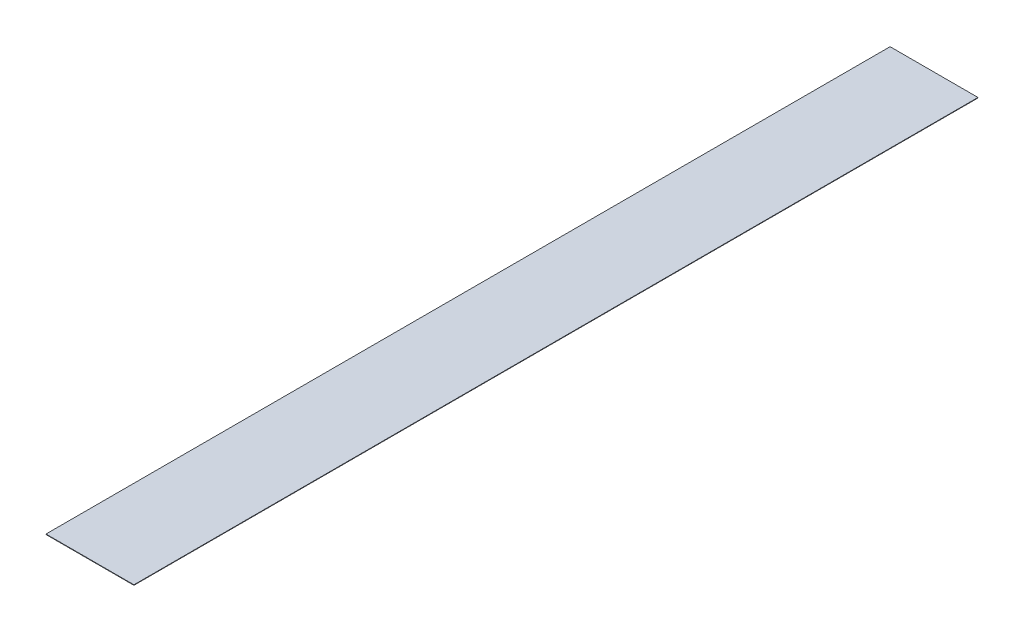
ISO-10303-21;
HEADER;
FILE_DESCRIPTION(('STEP AP214'),'2;1');
FILE_NAME('part.step','',(''),(''),'','','');
FILE_SCHEMA(('AUTOMOTIVE_DESIGN { 1 0 10303 214 1 1 1 1 }'));
ENDSEC;
DATA;
#1=APPLICATION_CONTEXT('core data for automotive mechanical design processes');
#2=APPLICATION_PROTOCOL_DEFINITION('international standard','automotive_design',2000,#1);
#3=PRODUCT_CONTEXT('',#1,'mechanical');
#4=PRODUCT('Part','Part','',(#3));
#5=PRODUCT_RELATED_PRODUCT_CATEGORY('part','',(#4));
#6=PRODUCT_DEFINITION_FORMATION('','',#4);
#7=PRODUCT_DEFINITION_CONTEXT('part definition',#1,'design');
#8=PRODUCT_DEFINITION('design','',#6,#7);
#9=PRODUCT_DEFINITION_SHAPE('','',#8);
#10=(LENGTH_UNIT() NAMED_UNIT(*) SI_UNIT(.MILLI.,.METRE.));
#11=(NAMED_UNIT(*) PLANE_ANGLE_UNIT() SI_UNIT($,.RADIAN.));
#12=(NAMED_UNIT(*) SI_UNIT($,.STERADIAN.) SOLID_ANGLE_UNIT());
#13=UNCERTAINTY_MEASURE_WITH_UNIT(LENGTH_MEASURE(1.E-05),#10,'distance_accuracy_value','');
#14=(GEOMETRIC_REPRESENTATION_CONTEXT(3) GLOBAL_UNCERTAINTY_ASSIGNED_CONTEXT((#13)) GLOBAL_UNIT_ASSIGNED_CONTEXT((#10,
#11,#12)) REPRESENTATION_CONTEXT('',''));
#15=CARTESIAN_POINT('',(0.,0.,0.));
#16=DIRECTION('',(0.,0.,1.));
#17=DIRECTION('',(1.,0.,0.));
#18=AXIS2_PLACEMENT_3D('',#15,#16,#17);
#19=CARTESIAN_POINT('',(23.8125,0.254,228.6));
#20=DIRECTION('',(-1.,0.,0.));
#21=DIRECTION('',(0.,0.,1.));
#22=AXIS2_PLACEMENT_3D('',#19,#20,#21);
#23=PLANE('',#22);
#24=DIRECTION('',(0.,0.,-1.));
#25=VECTOR('',#24,1.);
#26=CARTESIAN_POINT('',(23.8125,0.,228.6));
#27=LINE('',#26,#25);
#28=CARTESIAN_POINT('',(23.8125,0.,228.6));
#29=VERTEX_POINT('',#28);
#30=CARTESIAN_POINT('',(23.8125,0.,-228.6));
#31=VERTEX_POINT('',#30);
#32=EDGE_CURVE('E99',#29,#31,#27,.T.);
#33=ORIENTED_EDGE('',*,*,#32,.T.);
#34=DIRECTION('',(0.,-1.,0.));
#35=VECTOR('',#34,1.);
#36=CARTESIAN_POINT('',(23.8125,0.254,-228.6));
#37=LINE('',#36,#35);
#38=CARTESIAN_POINT('',(23.8125,0.254,-228.6));
#39=VERTEX_POINT('',#38);
#40=EDGE_CURVE('E11',#39,#31,#37,.T.);
#41=ORIENTED_EDGE('',*,*,#40,.F.);
#42=DIRECTION('',(0.,0.,-1.));
#43=VECTOR('',#42,1.);
#44=CARTESIAN_POINT('',(23.8125,0.254,228.6));
#45=LINE('',#44,#43);
#46=CARTESIAN_POINT('',(23.8125,0.254,228.6));
#47=VERTEX_POINT('',#46);
#48=EDGE_CURVE('E87',#47,#39,#45,.T.);
#49=ORIENTED_EDGE('',*,*,#48,.F.);
#50=DIRECTION('',(0.,-1.,0.));
#51=VECTOR('',#50,1.);
#52=CARTESIAN_POINT('',(23.8125,0.254,228.6));
#53=LINE('',#52,#51);
#54=EDGE_CURVE('E95',#47,#29,#53,.T.);
#55=ORIENTED_EDGE('',*,*,#54,.T.);
#56=EDGE_LOOP('',(#33,#41,#49,#55));
#57=FACE_BOUND('',#56,.T.);
#58=ADVANCED_FACE('F36',(#57),#23,.F.);
#59=CARTESIAN_POINT('',(23.8125,0.254,-228.6));
#60=DIRECTION('',(0.,0.,1.));
#61=DIRECTION('',(1.,0.,0.));
#62=AXIS2_PLACEMENT_3D('',#59,#60,#61);
#63=PLANE('',#62);
#64=DIRECTION('',(-1.,0.,0.));
#65=VECTOR('',#64,1.);
#66=CARTESIAN_POINT('',(23.8125,0.,-228.6));
#67=LINE('',#66,#65);
#68=CARTESIAN_POINT('',(-23.8125,0.,-228.6));
#69=VERTEX_POINT('',#68);
#70=EDGE_CURVE('E91',#31,#69,#67,.T.);
#71=ORIENTED_EDGE('',*,*,#70,.T.);
#72=DIRECTION('',(0.,-1.,0.));
#73=VECTOR('',#72,1.);
#74=CARTESIAN_POINT('',(-23.8125,0.254,-228.6));
#75=LINE('',#74,#73);
#76=CARTESIAN_POINT('',(-23.8125,0.254,-228.6));
#77=VERTEX_POINT('',#76);
#78=EDGE_CURVE('E44',#77,#69,#75,.T.);
#79=ORIENTED_EDGE('',*,*,#78,.F.);
#80=DIRECTION('',(-1.,0.,0.));
#81=VECTOR('',#80,1.);
#82=CARTESIAN_POINT('',(23.8125,0.254,-228.6));
#83=LINE('',#82,#81);
#84=EDGE_CURVE('E82',#39,#77,#83,.T.);
#85=ORIENTED_EDGE('',*,*,#84,.F.);
#86=ORIENTED_EDGE('',*,*,#40,.T.);
#87=EDGE_LOOP('',(#71,#79,#85,#86));
#88=FACE_BOUND('',#87,.T.);
#89=ADVANCED_FACE('F90',(#88),#63,.F.);
#90=CARTESIAN_POINT('',(-23.8125,0.254,228.6));
#91=DIRECTION('',(1.,0.,0.));
#92=DIRECTION('',(0.,0.,-1.));
#93=AXIS2_PLACEMENT_3D('',#90,#91,#92);
#94=PLANE('',#93);
#95=DIRECTION('',(0.,0.,1.));
#96=VECTOR('',#95,1.);
#97=CARTESIAN_POINT('',(-23.8125,0.,228.6));
#98=LINE('',#97,#96);
#99=CARTESIAN_POINT('',(-23.8125,0.,228.6));
#100=VERTEX_POINT('',#99);
#101=EDGE_CURVE('E69',#69,#100,#98,.T.);
#102=ORIENTED_EDGE('',*,*,#101,.T.);
#103=DIRECTION('',(0.,-1.,0.));
#104=VECTOR('',#103,1.);
#105=CARTESIAN_POINT('',(-23.8125,0.254,228.6));
#106=LINE('',#105,#104);
#107=CARTESIAN_POINT('',(-23.8125,0.254,228.6));
#108=VERTEX_POINT('',#107);
#109=EDGE_CURVE('E92',#108,#100,#106,.T.);
#110=ORIENTED_EDGE('',*,*,#109,.F.);
#111=DIRECTION('',(0.,0.,1.));
#112=VECTOR('',#111,1.);
#113=CARTESIAN_POINT('',(-23.8125,0.254,228.6));
#114=LINE('',#113,#112);
#115=EDGE_CURVE('E85',#77,#108,#114,.T.);
#116=ORIENTED_EDGE('',*,*,#115,.F.);
#117=ORIENTED_EDGE('',*,*,#78,.T.);
#118=EDGE_LOOP('',(#102,#110,#116,#117));
#119=FACE_BOUND('',#118,.T.);
#120=ADVANCED_FACE('F93',(#119),#94,.F.);
#121=CARTESIAN_POINT('',(23.8125,0.254,228.6));
#122=DIRECTION('',(0.,0.,-1.));
#123=DIRECTION('',(-1.,0.,0.));
#124=AXIS2_PLACEMENT_3D('',#121,#122,#123);
#125=PLANE('',#124);
#126=DIRECTION('',(1.,0.,0.));
#127=VECTOR('',#126,1.);
#128=CARTESIAN_POINT('',(23.8125,0.,228.6));
#129=LINE('',#128,#127);
#130=EDGE_CURVE('E75',#100,#29,#129,.T.);
#131=ORIENTED_EDGE('',*,*,#130,.T.);
#132=ORIENTED_EDGE('',*,*,#54,.F.);
#133=DIRECTION('',(1.,0.,0.));
#134=VECTOR('',#133,1.);
#135=CARTESIAN_POINT('',(23.8125,0.254,228.6));
#136=LINE('',#135,#134);
#137=EDGE_CURVE('E52',#108,#47,#136,.T.);
#138=ORIENTED_EDGE('',*,*,#137,.F.);
#139=ORIENTED_EDGE('',*,*,#109,.T.);
#140=EDGE_LOOP('',(#131,#132,#138,#139));
#141=FACE_BOUND('',#140,.T.);
#142=ADVANCED_FACE('F106',(#141),#125,.F.);
#143=CARTESIAN_POINT('',(0.,0.254,0.));
#144=DIRECTION('',(0.,1.,0.));
#145=DIRECTION('',(0.,0.,1.));
#146=AXIS2_PLACEMENT_3D('',#143,#144,#145);
#147=PLANE('',#146);
#148=ORIENTED_EDGE('',*,*,#48,.T.);
#149=ORIENTED_EDGE('',*,*,#84,.T.);
#150=ORIENTED_EDGE('',*,*,#115,.T.);
#151=ORIENTED_EDGE('',*,*,#137,.T.);
#152=EDGE_LOOP('',(#148,#149,#150,#151));
#153=FACE_BOUND('',#152,.T.);
#154=ADVANCED_FACE('F83',(#153),#147,.T.);
#155=CARTESIAN_POINT('',(0.,0.,0.));
#156=DIRECTION('',(0.,1.,0.));
#157=DIRECTION('',(0.,0.,1.));
#158=AXIS2_PLACEMENT_3D('',#155,#156,#157);
#159=PLANE('',#158);
#160=ORIENTED_EDGE('',*,*,#32,.F.);
#161=ORIENTED_EDGE('',*,*,#130,.F.);
#162=ORIENTED_EDGE('',*,*,#101,.F.);
#163=ORIENTED_EDGE('',*,*,#70,.F.);
#164=EDGE_LOOP('',(#160,#161,#162,#163));
#165=FACE_BOUND('',#164,.T.);
#166=ADVANCED_FACE('F109',(#165),#159,.F.);
#167=CLOSED_SHELL('',(#58,#89,#120,#142,#154,#166));
#168=MANIFOLD_SOLID_BREP('B2',#167);
#169=ADVANCED_BREP_SHAPE_REPRESENTATION('',(#18,#168),#14);
#170=SHAPE_DEFINITION_REPRESENTATION(#9,#169);
ENDSEC;
END-ISO-10303-21;
